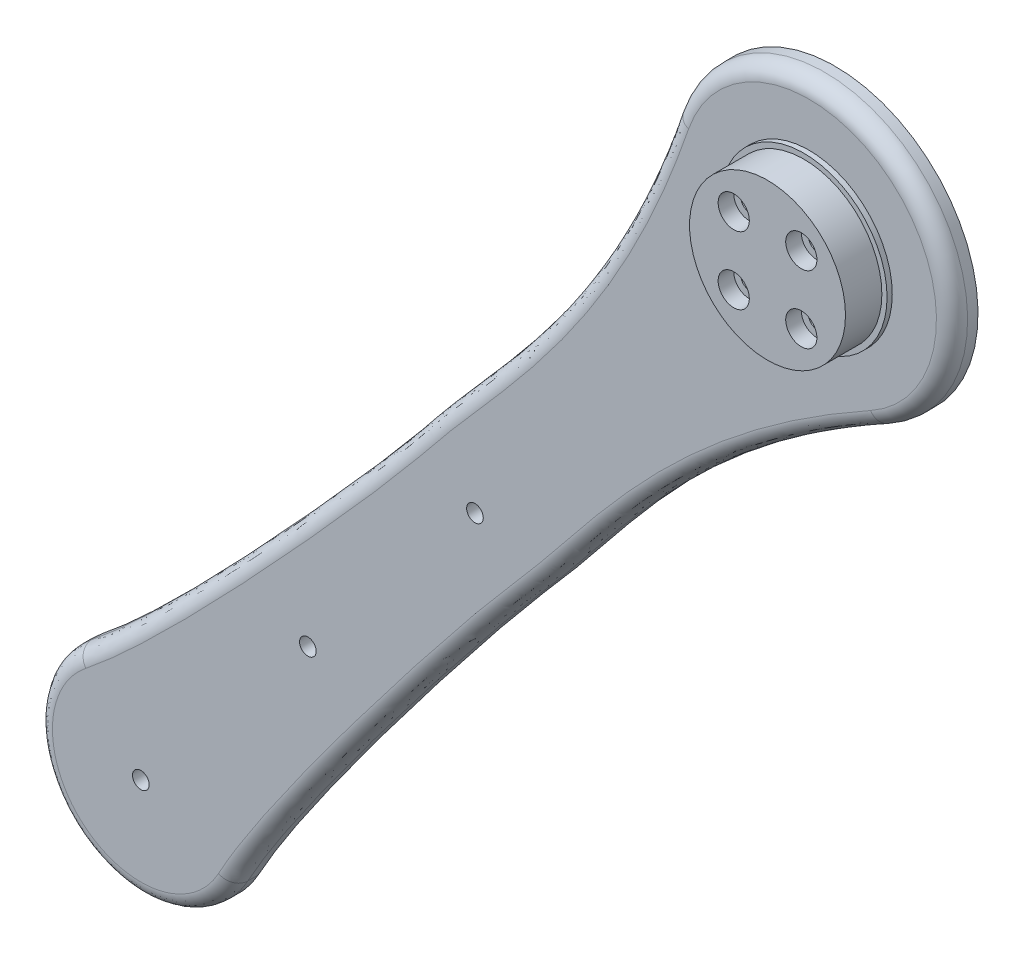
ISO-10303-21;
HEADER;
FILE_DESCRIPTION(('STEP AP214'),'2;1');
FILE_NAME('part.step','',(''),(''),'','','');
FILE_SCHEMA(('AUTOMOTIVE_DESIGN { 1 0 10303 214 1 1 1 1 }'));
ENDSEC;
DATA;
#1=APPLICATION_CONTEXT('core data for automotive mechanical design processes');
#2=APPLICATION_PROTOCOL_DEFINITION('international standard','automotive_design',2000,#1);
#3=PRODUCT_CONTEXT('',#1,'mechanical');
#4=PRODUCT('Part','Part','',(#3));
#5=PRODUCT_RELATED_PRODUCT_CATEGORY('part','',(#4));
#6=PRODUCT_DEFINITION_FORMATION('','',#4);
#7=PRODUCT_DEFINITION_CONTEXT('part definition',#1,'design');
#8=PRODUCT_DEFINITION('design','',#6,#7);
#9=PRODUCT_DEFINITION_SHAPE('','',#8);
#10=(LENGTH_UNIT() NAMED_UNIT(*) SI_UNIT(.MILLI.,.METRE.));
#11=(NAMED_UNIT(*) PLANE_ANGLE_UNIT() SI_UNIT($,.RADIAN.));
#12=(NAMED_UNIT(*) SI_UNIT($,.STERADIAN.) SOLID_ANGLE_UNIT());
#13=UNCERTAINTY_MEASURE_WITH_UNIT(LENGTH_MEASURE(1.E-05),#10,'distance_accuracy_value','');
#14=(GEOMETRIC_REPRESENTATION_CONTEXT(3) GLOBAL_UNCERTAINTY_ASSIGNED_CONTEXT((#13)) GLOBAL_UNIT_ASSIGNED_CONTEXT((#10,
#11,#12)) REPRESENTATION_CONTEXT('',''));
#15=CARTESIAN_POINT('',(0.,0.,0.));
#16=DIRECTION('',(0.,0.,1.));
#17=DIRECTION('',(1.,0.,0.));
#18=AXIS2_PLACEMENT_3D('',#15,#16,#17);
#19=CARTESIAN_POINT('',(148.218221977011,-112.41570779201,36.));
#20=DIRECTION('',(0.,0.,-1.));
#21=DIRECTION('',(-1.,0.,0.));
#22=AXIS2_PLACEMENT_3D('',#19,#20,#21);
#23=CYLINDRICAL_SURFACE('',#22,1.59999999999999);
#24=CARTESIAN_POINT('',(148.218221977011,-112.41570779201,31.));
#25=DIRECTION('',(0.,0.,1.));
#26=DIRECTION('',(1.,0.,0.));
#27=AXIS2_PLACEMENT_3D('',#24,#25,#26);
#28=CIRCLE('',#27,1.59999999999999);
#29=CARTESIAN_POINT('',(149.818221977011,-112.41570779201,31.));
#30=VERTEX_POINT('',#29);
#31=EDGE_CURVE('E124',#30,#30,#28,.T.);
#32=ORIENTED_EDGE('',*,*,#31,.F.);
#33=EDGE_LOOP('',(#32));
#34=FACE_BOUND('',#33,.T.);
#35=CARTESIAN_POINT('',(148.218221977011,-112.41570779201,41.));
#36=DIRECTION('',(0.,0.,1.));
#37=DIRECTION('',(1.,0.,0.));
#38=AXIS2_PLACEMENT_3D('',#35,#36,#37);
#39=CIRCLE('',#38,1.59999999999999);
#40=CARTESIAN_POINT('',(149.818221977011,-112.41570779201,41.));
#41=VERTEX_POINT('',#40);
#42=EDGE_CURVE('E225',#41,#41,#39,.T.);
#43=ORIENTED_EDGE('',*,*,#42,.T.);
#44=EDGE_LOOP('',(#43));
#45=FACE_BOUND('',#44,.T.);
#46=ADVANCED_FACE('F43',(#34,#45),#23,.F.);
#47=CARTESIAN_POINT('',(135.218221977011,-112.41570779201,36.));
#48=DIRECTION('',(0.,0.,-1.));
#49=DIRECTION('',(-1.,0.,0.));
#50=AXIS2_PLACEMENT_3D('',#47,#48,#49);
#51=CYLINDRICAL_SURFACE('',#50,1.59999999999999);
#52=CARTESIAN_POINT('',(135.218221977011,-112.41570779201,31.));
#53=DIRECTION('',(0.,0.,1.));
#54=DIRECTION('',(1.,0.,0.));
#55=AXIS2_PLACEMENT_3D('',#52,#53,#54);
#56=CIRCLE('',#55,1.59999999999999);
#57=CARTESIAN_POINT('',(136.818221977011,-112.41570779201,31.));
#58=VERTEX_POINT('',#57);
#59=EDGE_CURVE('E127',#58,#58,#56,.T.);
#60=ORIENTED_EDGE('',*,*,#59,.F.);
#61=EDGE_LOOP('',(#60));
#62=FACE_BOUND('',#61,.T.);
#63=CARTESIAN_POINT('',(135.218221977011,-112.41570779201,41.));
#64=DIRECTION('',(0.,0.,1.));
#65=DIRECTION('',(1.,0.,0.));
#66=AXIS2_PLACEMENT_3D('',#63,#64,#65);
#67=CIRCLE('',#66,1.59999999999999);
#68=CARTESIAN_POINT('',(136.818221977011,-112.41570779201,41.));
#69=VERTEX_POINT('',#68);
#70=EDGE_CURVE('E361',#69,#69,#67,.T.);
#71=ORIENTED_EDGE('',*,*,#70,.T.);
#72=EDGE_LOOP('',(#71));
#73=FACE_BOUND('',#72,.T.);
#74=ADVANCED_FACE('F309',(#62,#73),#51,.F.);
#75=CARTESIAN_POINT('',(148.218221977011,-125.41570779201,36.));
#76=DIRECTION('',(0.,0.,-1.));
#77=DIRECTION('',(-1.,0.,0.));
#78=AXIS2_PLACEMENT_3D('',#75,#76,#77);
#79=CYLINDRICAL_SURFACE('',#78,1.59999999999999);
#80=CARTESIAN_POINT('',(148.218221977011,-125.41570779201,31.));
#81=DIRECTION('',(0.,0.,1.));
#82=DIRECTION('',(1.,0.,0.));
#83=AXIS2_PLACEMENT_3D('',#80,#81,#82);
#84=CIRCLE('',#83,1.59999999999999);
#85=CARTESIAN_POINT('',(149.818221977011,-125.41570779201,31.));
#86=VERTEX_POINT('',#85);
#87=EDGE_CURVE('E189',#86,#86,#84,.T.);
#88=ORIENTED_EDGE('',*,*,#87,.F.);
#89=EDGE_LOOP('',(#88));
#90=FACE_BOUND('',#89,.T.);
#91=CARTESIAN_POINT('',(148.218221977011,-125.41570779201,41.));
#92=DIRECTION('',(0.,0.,1.));
#93=DIRECTION('',(1.,0.,0.));
#94=AXIS2_PLACEMENT_3D('',#91,#92,#93);
#95=CIRCLE('',#94,1.59999999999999);
#96=CARTESIAN_POINT('',(149.818221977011,-125.41570779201,41.));
#97=VERTEX_POINT('',#96);
#98=EDGE_CURVE('E358',#97,#97,#95,.T.);
#99=ORIENTED_EDGE('',*,*,#98,.T.);
#100=EDGE_LOOP('',(#99));
#101=FACE_BOUND('',#100,.T.);
#102=ADVANCED_FACE('F315',(#90,#101),#79,.F.);
#103=CARTESIAN_POINT('',(135.218221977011,-125.41570779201,36.));
#104=DIRECTION('',(0.,0.,-1.));
#105=DIRECTION('',(-1.,0.,0.));
#106=AXIS2_PLACEMENT_3D('',#103,#104,#105);
#107=CYLINDRICAL_SURFACE('',#106,1.59999999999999);
#108=CARTESIAN_POINT('',(135.218221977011,-125.41570779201,31.));
#109=DIRECTION('',(0.,0.,1.));
#110=DIRECTION('',(1.,0.,0.));
#111=AXIS2_PLACEMENT_3D('',#108,#109,#110);
#112=CIRCLE('',#111,1.59999999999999);
#113=CARTESIAN_POINT('',(136.818221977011,-125.41570779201,31.));
#114=VERTEX_POINT('',#113);
#115=EDGE_CURVE('E192',#114,#114,#112,.T.);
#116=ORIENTED_EDGE('',*,*,#115,.F.);
#117=EDGE_LOOP('',(#116));
#118=FACE_BOUND('',#117,.T.);
#119=CARTESIAN_POINT('',(135.218221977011,-125.41570779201,41.));
#120=DIRECTION('',(0.,0.,1.));
#121=DIRECTION('',(1.,0.,0.));
#122=AXIS2_PLACEMENT_3D('',#119,#120,#121);
#123=CIRCLE('',#122,1.59999999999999);
#124=CARTESIAN_POINT('',(136.818221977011,-125.41570779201,41.));
#125=VERTEX_POINT('',#124);
#126=EDGE_CURVE('E233',#125,#125,#123,.T.);
#127=ORIENTED_EDGE('',*,*,#126,.T.);
#128=EDGE_LOOP('',(#127));
#129=FACE_BOUND('',#128,.T.);
#130=ADVANCED_FACE('F287',(#118,#129),#107,.F.);
#131=CARTESIAN_POINT('',(76.5989589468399,-175.143739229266,36.));
#132=DIRECTION('',(0.,0.,1.));
#133=DIRECTION('',(1.,0.,0.));
#134=AXIS2_PLACEMENT_3D('',#131,#132,#133);
#135=PLANE('',#134);
#136=CARTESIAN_POINT('',(2.58991826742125,-258.810747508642,36.));
#137=CARTESIAN_POINT('',(6.1972455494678,-255.946641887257,36.));
#138=CARTESIAN_POINT('',(10.4993930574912,-252.03269432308,36.));
#139=CARTESIAN_POINT('',(19.8643080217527,-242.967357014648,36.));
#140=CARTESIAN_POINT('',(24.9218403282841,-237.816883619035,36.));
#141=CARTESIAN_POINT('',(40.112106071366,-221.887775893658,36.));
#142=CARTESIAN_POINT('',(50.2589573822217,-210.634653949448,36.));
#143=CARTESIAN_POINT('',(59.1915358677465,-200.421978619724,36.));
#144=CARTESIAN_POINT('',(60.7905215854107,-198.57206986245,36.));
#145=CARTESIAN_POINT('',(63.521691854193,-195.370215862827,36.));
#146=CARTESIAN_POINT('',(64.6537458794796,-194.018479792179,36.));
#147=CARTESIAN_POINT('',(67.5813511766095,-190.476104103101,36.));
#148=CARTESIAN_POINT('',(68.9057809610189,-188.801822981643,36.));
#149=CARTESIAN_POINT('',(70.5388406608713,-186.801529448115,36.));
#150=CARTESIAN_POINT('',(70.8660700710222,-186.404271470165,36.));
#151=CARTESIAN_POINT('',(71.5336551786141,-185.601365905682,36.));
#152=CARTESIAN_POINT('',(71.8724257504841,-185.197431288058,36.));
#153=CARTESIAN_POINT('',(72.9029751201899,-183.977385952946,36.));
#154=CARTESIAN_POINT('',(73.6089943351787,-183.153036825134,36.));
#155=CARTESIAN_POINT('',(75.7783171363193,-180.640553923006,36.));
#156=CARTESIAN_POINT('',(77.2929055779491,-178.913024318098,36.));
#157=CARTESIAN_POINT('',(85.1297962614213,-169.923589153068,36.));
#158=CARTESIAN_POINT('',(92.2433853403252,-161.608858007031,36.));
#159=CARTESIAN_POINT('',(106.13347228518,-140.352759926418,36.));
#160=CARTESIAN_POINT('',(112.905809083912,-127.409635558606,36.));
#161=CARTESIAN_POINT('',(118.542636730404,-110.969498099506,36.));
#162=(BOUNDED_CURVE() B_SPLINE_CURVE(3,(#136,#137,#138,#139,#140,#141,#142,#143,#144,#145,#146,
#147,#148,#149,#150,#151,#152,#153,#154,#155,#156,#157,#158,#159,#160,#161),.UNSPECIFIED.,.F.,
.F.) B_SPLINE_CURVE_WITH_KNOTS((4,2,2,2,2,2,2,2,2,2,2,2,4),(0.,0.0625,0.125,0.25,0.28125,0.3125,
0.375,0.390625,0.40625,0.4375,0.5,0.75,1.),
.UNSPECIFIED.) CURVE() GEOMETRIC_REPRESENTATION_ITEM() RATIONAL_B_SPLINE_CURVE((1.,1.,1.,1.,1.,
1.,1.,1.,1.,1.,1.,1.,1.,1.,1.,1.,1.,1.,1.,1.,1.,1.,1.,1.,1.,1.)) REPRESENTATION_ITEM(''));
#163=CARTESIAN_POINT('',(118.542636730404,-110.969498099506,36.));
#164=VERTEX_POINT('',#163);
#165=CARTESIAN_POINT('',(2.58991826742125,-258.810747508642,36.));
#166=VERTEX_POINT('',#165);
#167=EDGE_CURVE('E381',#164,#166,#162,.F.);
#168=ORIENTED_EDGE('',*,*,#167,.T.);
#169=CARTESIAN_POINT('',(28.107878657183,-280.222858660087,36.));
#170=CARTESIAN_POINT('',(27.509808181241,-281.326733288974,36.));
#171=CARTESIAN_POINT('',(26.7890058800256,-282.364003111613,36.));
#172=CARTESIAN_POINT('',(25.1369941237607,-284.254911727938,36.));
#173=CARTESIAN_POINT('',(24.2058618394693,-285.108454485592,36.));
#174=CARTESIAN_POINT('',(22.1787149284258,-286.590127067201,36.));
#175=CARTESIAN_POINT('',(21.0827815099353,-287.218197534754,36.));
#176=CARTESIAN_POINT('',(18.7795953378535,-288.218203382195,36.));
#177=CARTESIAN_POINT('',(17.5724348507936,-288.590098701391,36.));
#178=CARTESIAN_POINT('',(15.1057993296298,-289.059553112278,36.));
#179=CARTESIAN_POINT('',(13.846423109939,-289.157093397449,36.));
#180=CARTESIAN_POINT('',(11.3369182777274,-289.073047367,36.));
#181=CARTESIAN_POINT('',(10.0868901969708,-288.89146441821,36.));
#182=CARTESIAN_POINT('',(7.65719173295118,-288.258026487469,36.));
#183=CARTESIAN_POINT('',(6.47761868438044,-287.806196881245,36.));
#184=CARTESIAN_POINT('',(4.2465009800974,-286.654332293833,36.));
#185=CARTESIAN_POINT('',(3.1950457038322,-285.954343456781,36.));
#186=CARTESIAN_POINT('',(1.27157564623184,-284.340360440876,36.));
#187=CARTESIAN_POINT('',(0.399637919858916,-283.426430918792,36.));
#188=CARTESIAN_POINT('',(-1.12215677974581,-281.429228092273,36.));
#189=CARTESIAN_POINT('',(-1.77195278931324,-280.346034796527,36.));
#190=CARTESIAN_POINT('',(-2.81768008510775,-278.06324425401,36.));
#191=CARTESIAN_POINT('',(-3.21356947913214,-276.863738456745,36.));
#192=CARTESIAN_POINT('',(-3.73210960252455,-274.406953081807,36.));
#193=CARTESIAN_POINT('',(-3.85473955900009,-273.149771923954,36.));
#194=CARTESIAN_POINT('',(-3.82074397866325,-270.639090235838,36.));
#195=CARTESIAN_POINT('',(-3.66411980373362,-269.38569028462,36.));
#196=CARTESIAN_POINT('',(-3.07925037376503,-266.943845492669,36.));
#197=CARTESIAN_POINT('',(-2.6510285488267,-265.755498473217,36.));
#198=CARTESIAN_POINT('',(-1.5438762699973,-263.501858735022,36.));
#199=CARTESIAN_POINT('',(-0.86499016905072,-262.436656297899,36.));
#200=CARTESIAN_POINT('',(0.710322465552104,-260.481389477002,36.));
#201=CARTESIAN_POINT('',(1.60666782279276,-259.59141776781,36.));
#202=CARTESIAN_POINT('',(2.58991826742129,-258.810747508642,36.));
#203=(BOUNDED_CURVE() B_SPLINE_CURVE(3,(#169,#170,#171,#172,#173,#174,#175,#176,#177,#178,#179,
#180,#181,#182,#183,#184,#185,#186,#187,#188,#189,#190,#191,#192,#193,#194,#195,#196,#197,#198,
#199,#200,#201,#202),.UNSPECIFIED.,.F.,.F.) B_SPLINE_CURVE_WITH_KNOTS((4,2,2,2,2,2,2,2,2,2,2,2,
2,2,2,2,4),(2.24184892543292,2.46339996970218,2.68495101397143,2.90650205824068,
3.12805310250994,3.34960414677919,3.57115519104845,3.7927062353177,4.01425727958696,
4.23580832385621,4.45735936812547,4.67891041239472,4.90046145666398,5.12201250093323,
5.34356354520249,5.56511458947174,5.786665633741),
.UNSPECIFIED.) CURVE() GEOMETRIC_REPRESENTATION_ITEM() RATIONAL_B_SPLINE_CURVE((1.,1.,1.,1.,1.,
1.,1.,1.,1.,1.,1.,1.,1.,1.,1.,1.,1.,1.,1.,1.,1.,1.,1.,1.,1.,1.,1.,1.,1.,1.,1.,1.,1.,1.)) REPRESENTATION_ITEM(''));
#204=CARTESIAN_POINT('',(28.107878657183,-280.222858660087,36.));
#205=VERTEX_POINT('',#204);
#206=EDGE_CURVE('E343',#166,#205,#203,.F.);
#207=ORIENTED_EDGE('',*,*,#206,.T.);
#208=CARTESIAN_POINT('',(153.568109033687,-140.359358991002,36.));
#209=CARTESIAN_POINT('',(138.356559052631,-148.765350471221,36.));
#210=CARTESIAN_POINT('',(126.786073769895,-157.682350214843,36.));
#211=CARTESIAN_POINT('',(108.264891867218,-175.052498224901,36.));
#212=CARTESIAN_POINT('',(101.311741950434,-183.501853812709,36.));
#213=CARTESIAN_POINT('',(93.8197382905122,-192.780683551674,36.));
#214=CARTESIAN_POINT('',(92.3814592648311,-194.572244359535,36.));
#215=CARTESIAN_POINT('',(90.2838455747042,-197.144898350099,36.));
#216=CARTESIAN_POINT('',(89.594619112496,-197.983338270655,36.));
#217=CARTESIAN_POINT('',(88.5720620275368,-199.210089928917,36.));
#218=CARTESIAN_POINT('',(88.2330909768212,-199.613856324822,36.));
#219=CARTESIAN_POINT('',(87.55830828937,-200.410722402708,36.));
#220=CARTESIAN_POINT('',(87.223908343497,-200.80196358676,36.));
#221=CARTESIAN_POINT('',(85.5375816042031,-202.757560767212,36.));
#222=CARTESIAN_POINT('',(84.1187213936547,-204.352605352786,36.));
#223=CARTESIAN_POINT('',(81.1385356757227,-207.850860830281,36.));
#224=CARTESIAN_POINT('',(80.0039146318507,-209.200442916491,36.));
#225=CARTESIAN_POINT('',(77.3249667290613,-212.446116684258,36.));
#226=CARTESIAN_POINT('',(75.7808231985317,-214.34204350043,36.));
#227=CARTESIAN_POINT('',(67.2744273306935,-224.912328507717,36.));
#228=CARTESIAN_POINT('',(57.9542478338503,-236.859110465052,36.));
#229=CARTESIAN_POINT('',(44.9049010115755,-254.584662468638,36.));
#230=CARTESIAN_POINT('',(40.710906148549,-260.459729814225,36.));
#231=CARTESIAN_POINT('',(33.4094921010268,-271.256549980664,36.));
#232=CARTESIAN_POINT('',(30.3020662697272,-276.172988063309,36.));
#233=CARTESIAN_POINT('',(28.107878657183,-280.222858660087,36.));
#234=(BOUNDED_CURVE() B_SPLINE_CURVE(3,(#208,#209,#210,#211,#212,#213,#214,#215,#216,#217,#218,
#219,#220,#221,#222,#223,#224,#225,#226,#227,#228,#229,#230,#231,#232,#233),.UNSPECIFIED.,.F.,
.F.) B_SPLINE_CURVE_WITH_KNOTS((4,2,2,2,2,2,2,2,2,2,2,2,4),(0.,0.25,0.5,0.5625,0.59375,0.609375,
0.625,0.6875,0.71875,0.75,0.875,0.9375,1.),
.UNSPECIFIED.) CURVE() GEOMETRIC_REPRESENTATION_ITEM() RATIONAL_B_SPLINE_CURVE((1.,1.,1.,1.,1.,
1.,1.,1.,1.,1.,1.,1.,1.,1.,1.,1.,1.,1.,1.,1.,1.,1.,1.,1.,1.,1.)) REPRESENTATION_ITEM(''));
#235=CARTESIAN_POINT('',(153.568109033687,-140.359358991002,36.));
#236=VERTEX_POINT('',#235);
#237=EDGE_CURVE('E222',#205,#236,#234,.F.);
#238=ORIENTED_EDGE('',*,*,#237,.T.);
#239=CARTESIAN_POINT('',(141.718221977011,-118.91570779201,36.));
#240=DIRECTION('',(0.,0.,1.));
#241=DIRECTION('',(1.,0.,0.));
#242=AXIS2_PLACEMENT_3D('',#239,#240,#241);
#243=CIRCLE('',#242,24.5);
#244=EDGE_CURVE('E367',#236,#164,#243,.T.);
#245=ORIENTED_EDGE('',*,*,#244,.T.);
#246=EDGE_LOOP('',(#168,#207,#238,#245));
#247=FACE_BOUND('',#246,.T.);
#248=CARTESIAN_POINT('',(141.718221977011,-118.91570779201,36.));
#249=DIRECTION('',(0.,0.,1.));
#250=DIRECTION('',(1.,0.,0.));
#251=AXIS2_PLACEMENT_3D('',#248,#249,#250);
#252=CIRCLE('',#251,16.);
#253=CARTESIAN_POINT('',(157.718221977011,-118.91570779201,36.));
#254=VERTEX_POINT('',#253);
#255=EDGE_CURVE('E214',#254,#254,#252,.T.);
#256=ORIENTED_EDGE('',*,*,#255,.F.);
#257=EDGE_LOOP('',(#256));
#258=FACE_BOUND('',#257,.T.);
#259=CARTESIAN_POINT('',(45.3000805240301,-233.822374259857,36.));
#260=DIRECTION('',(0.,0.,1.));
#261=DIRECTION('',(1.,0.,0.));
#262=AXIS2_PLACEMENT_3D('',#259,#260,#261);
#263=CIRCLE('',#262,1.6);
#264=CARTESIAN_POINT('',(46.9000805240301,-233.822374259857,36.));
#265=VERTEX_POINT('',#264);
#266=EDGE_CURVE('E199',#265,#265,#263,.T.);
#267=ORIENTED_EDGE('',*,*,#266,.F.);
#268=EDGE_LOOP('',(#267));
#269=FACE_BOUND('',#268,.T.);
#270=CARTESIAN_POINT('',(77.439461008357,-195.520152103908,36.));
#271=DIRECTION('',(0.,0.,1.));
#272=DIRECTION('',(1.,0.,0.));
#273=AXIS2_PLACEMENT_3D('',#270,#271,#272);
#274=CIRCLE('',#273,1.60000000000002);
#275=CARTESIAN_POINT('',(79.039461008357,-195.520152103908,36.));
#276=VERTEX_POINT('',#275);
#277=EDGE_CURVE('E195',#276,#276,#274,.T.);
#278=ORIENTED_EDGE('',*,*,#277,.F.);
#279=EDGE_LOOP('',(#278));
#280=FACE_BOUND('',#279,.T.);
#281=CARTESIAN_POINT('',(13.1607000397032,-272.124596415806,36.));
#282=DIRECTION('',(0.,0.,1.));
#283=DIRECTION('',(1.,0.,0.));
#284=AXIS2_PLACEMENT_3D('',#281,#282,#283);
#285=CIRCLE('',#284,1.6);
#286=CARTESIAN_POINT('',(14.7607000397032,-272.124596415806,36.));
#287=VERTEX_POINT('',#286);
#288=EDGE_CURVE('E205',#287,#287,#285,.T.);
#289=ORIENTED_EDGE('',*,*,#288,.F.);
#290=EDGE_LOOP('',(#289));
#291=FACE_BOUND('',#290,.T.);
#292=ADVANCED_FACE('F284',(#247,#258,#269,#280,#291),#135,.T.);
#293=CARTESIAN_POINT('',(76.5989589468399,-175.143739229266,31.));
#294=DIRECTION('',(0.,0.,1.));
#295=DIRECTION('',(1.,0.,0.));
#296=AXIS2_PLACEMENT_3D('',#293,#294,#295);
#297=PLANE('',#296);
#298=CARTESIAN_POINT('',(115.704809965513,-109.996492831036,31.));
#299=CARTESIAN_POINT('',(101.948797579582,-150.116707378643,31.));
#300=CARTESIAN_POINT('',(78.1787907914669,-171.772825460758,31.));
#301=CARTESIAN_POINT('',(58.7170794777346,-197.082387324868,31.));
#302=CARTESIAN_POINT('',(16.3569995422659,-244.049515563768,31.));
#303=CARTESIAN_POINT('',(0.724486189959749,-256.461244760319,31.));
#304=B_SPLINE_CURVE_WITH_KNOTS('',3,(#298,#299,#300,#301,#302,#303),.UNSPECIFIED.,.F.,.F.,(4,1,
1,4),(0.,0.619090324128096,0.719090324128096,1.),.UNSPECIFIED.);
#305=CARTESIAN_POINT('',(115.704809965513,-109.996492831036,31.));
#306=VERTEX_POINT('',#305);
#307=CARTESIAN_POINT('',(0.724486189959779,-256.461244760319,31.));
#308=VERTEX_POINT('',#307);
#309=EDGE_CURVE('E117',#306,#308,#304,.T.);
#310=ORIENTED_EDGE('',*,*,#309,.F.);
#311=CARTESIAN_POINT('',(141.718221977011,-118.91570779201,31.));
#312=DIRECTION('',(0.,0.,1.));
#313=DIRECTION('',(1.,0.,0.));
#314=AXIS2_PLACEMENT_3D('',#311,#312,#313);
#315=CIRCLE('',#314,27.5);
#316=CARTESIAN_POINT('',(155.019115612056,-142.985112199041,31.));
#317=VERTEX_POINT('',#316);
#318=EDGE_CURVE('E143',#317,#306,#315,.T.);
#319=ORIENTED_EDGE('',*,*,#318,.F.);
#320=CARTESIAN_POINT('',(30.7456160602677,-281.651963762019,31.));
#321=CARTESIAN_POINT('',(40.2542257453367,-264.101669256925,31.));
#322=CARTESIAN_POINT('',(79.1520670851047,-214.229377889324,31.));
#323=CARTESIAN_POINT('',(100.697629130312,-190.668374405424,31.));
#324=CARTESIAN_POINT('',(117.89712375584,-163.498941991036,31.));
#325=CARTESIAN_POINT('',(155.019115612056,-142.985112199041,31.));
#326=B_SPLINE_CURVE_WITH_KNOTS('',3,(#320,#321,#322,#323,#324,#325),.UNSPECIFIED.,.F.,.F.,(4,1,
1,4),(0.,0.280909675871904,0.380909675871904,1.),.UNSPECIFIED.);
#327=CARTESIAN_POINT('',(30.7456160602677,-281.651963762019,31.));
#328=VERTEX_POINT('',#327);
#329=EDGE_CURVE('E119',#328,#317,#326,.T.);
#330=ORIENTED_EDGE('',*,*,#329,.F.);
#331=CARTESIAN_POINT('',(13.1607000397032,-272.124596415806,31.));
#332=DIRECTION('',(0.,0.,1.));
#333=DIRECTION('',(1.,0.,0.));
#334=AXIS2_PLACEMENT_3D('',#331,#332,#333);
#335=CIRCLE('',#334,20.);
#336=EDGE_CURVE('E103',#308,#328,#335,.T.);
#337=ORIENTED_EDGE('',*,*,#336,.F.);
#338=EDGE_LOOP('',(#310,#319,#330,#337));
#339=FACE_BOUND('',#338,.T.);
#340=ORIENTED_EDGE('',*,*,#31,.T.);
#341=EDGE_LOOP('',(#340));
#342=FACE_BOUND('',#341,.T.);
#343=ORIENTED_EDGE('',*,*,#59,.T.);
#344=EDGE_LOOP('',(#343));
#345=FACE_BOUND('',#344,.T.);
#346=ORIENTED_EDGE('',*,*,#87,.T.);
#347=EDGE_LOOP('',(#346));
#348=FACE_BOUND('',#347,.T.);
#349=ORIENTED_EDGE('',*,*,#115,.T.);
#350=EDGE_LOOP('',(#349));
#351=FACE_BOUND('',#350,.T.);
#352=CARTESIAN_POINT('',(77.439461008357,-195.520152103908,31.));
#353=DIRECTION('',(0.,0.,1.));
#354=DIRECTION('',(1.,0.,0.));
#355=AXIS2_PLACEMENT_3D('',#352,#353,#354);
#356=CIRCLE('',#355,1.60000000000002);
#357=CARTESIAN_POINT('',(79.039461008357,-195.520152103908,31.));
#358=VERTEX_POINT('',#357);
#359=EDGE_CURVE('E196',#358,#358,#356,.T.);
#360=ORIENTED_EDGE('',*,*,#359,.T.);
#361=EDGE_LOOP('',(#360));
#362=FACE_BOUND('',#361,.T.);
#363=CARTESIAN_POINT('',(45.3000805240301,-233.822374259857,31.));
#364=DIRECTION('',(0.,0.,1.));
#365=DIRECTION('',(1.,0.,0.));
#366=AXIS2_PLACEMENT_3D('',#363,#364,#365);
#367=CIRCLE('',#366,1.6);
#368=CARTESIAN_POINT('',(46.9000805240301,-233.822374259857,31.));
#369=VERTEX_POINT('',#368);
#370=EDGE_CURVE('E202',#369,#369,#367,.T.);
#371=ORIENTED_EDGE('',*,*,#370,.T.);
#372=EDGE_LOOP('',(#371));
#373=FACE_BOUND('',#372,.T.);
#374=CARTESIAN_POINT('',(13.1607000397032,-272.124596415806,31.));
#375=DIRECTION('',(0.,0.,1.));
#376=DIRECTION('',(1.,0.,0.));
#377=AXIS2_PLACEMENT_3D('',#374,#375,#376);
#378=CIRCLE('',#377,1.6);
#379=CARTESIAN_POINT('',(14.7607000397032,-272.124596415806,31.));
#380=VERTEX_POINT('',#379);
#381=EDGE_CURVE('E208',#380,#380,#378,.T.);
#382=ORIENTED_EDGE('',*,*,#381,.T.);
#383=EDGE_LOOP('',(#382));
#384=FACE_BOUND('',#383,.T.);
#385=ADVANCED_FACE('F114',(#339,#342,#345,#348,#351,#362,#373,#384),#297,.F.);
#386=CARTESIAN_POINT('',(115.704809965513,-109.996492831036,36.));
#387=CARTESIAN_POINT('',(101.948797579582,-150.116707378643,36.));
#388=CARTESIAN_POINT('',(78.1787907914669,-171.772825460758,36.));
#389=CARTESIAN_POINT('',(58.7170794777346,-197.082387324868,36.));
#390=CARTESIAN_POINT('',(16.3569995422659,-244.049515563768,36.));
#391=CARTESIAN_POINT('',(0.724486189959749,-256.461244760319,36.));
#392=B_SPLINE_CURVE_WITH_KNOTS('',3,(#386,#387,#388,#389,#390,#391),.UNSPECIFIED.,.F.,.F.,(4,1,
1,4),(0.,0.619090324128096,0.719090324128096,1.),.UNSPECIFIED.);
#393=DIRECTION('',(0.,0.,-1.));
#394=VECTOR('',#393,1.);
#395=SURFACE_OF_LINEAR_EXTRUSION('',#392,#394);
#396=DIRECTION('',(0.,0.,-1.));
#397=VECTOR('',#396,1.);
#398=CARTESIAN_POINT('',(0.724486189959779,-256.461244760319,36.));
#399=LINE('',#398,#397);
#400=CARTESIAN_POINT('',(0.724486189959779,-256.461244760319,33.));
#401=VERTEX_POINT('',#400);
#402=EDGE_CURVE('E99',#401,#308,#399,.T.);
#403=ORIENTED_EDGE('',*,*,#402,.F.);
#404=CARTESIAN_POINT('',(0.724486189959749,-256.461244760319,33.));
#405=CARTESIAN_POINT('',(16.3569995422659,-244.049515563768,33.));
#406=CARTESIAN_POINT('',(58.7170794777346,-197.082387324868,33.));
#407=CARTESIAN_POINT('',(78.1787907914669,-171.772825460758,33.));
#408=CARTESIAN_POINT('',(101.948797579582,-150.116707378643,33.));
#409=CARTESIAN_POINT('',(115.704809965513,-109.996492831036,33.));
#410=B_SPLINE_CURVE_WITH_KNOTS('',3,(#404,#405,#406,#407,#408,#409),.UNSPECIFIED.,.F.,.F.,(4,1,
1,4),(0.,0.280909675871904,0.380909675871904,1.),.UNSPECIFIED.);
#411=CARTESIAN_POINT('',(115.704809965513,-109.996492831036,33.));
#412=VERTEX_POINT('',#411);
#413=EDGE_CURVE('E68',#401,#412,#410,.T.);
#414=ORIENTED_EDGE('',*,*,#413,.T.);
#415=DIRECTION('',(0.,0.,-1.));
#416=VECTOR('',#415,1.);
#417=CARTESIAN_POINT('',(115.704809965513,-109.996492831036,36.));
#418=LINE('',#417,#416);
#419=EDGE_CURVE('E122',#412,#306,#418,.T.);
#420=ORIENTED_EDGE('',*,*,#419,.T.);
#421=ORIENTED_EDGE('',*,*,#309,.T.);
#422=EDGE_LOOP('',(#403,#414,#420,#421));
#423=FACE_BOUND('',#422,.T.);
#424=ADVANCED_FACE('F121',(#423),#395,.F.);
#425=CARTESIAN_POINT('',(13.1607000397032,-272.124596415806,36.));
#426=DIRECTION('',(0.,0.,-1.));
#427=DIRECTION('',(-1.,0.,0.));
#428=AXIS2_PLACEMENT_3D('',#425,#426,#427);
#429=CYLINDRICAL_SURFACE('',#428,20.);
#430=DIRECTION('',(0.,0.,-1.));
#431=VECTOR('',#430,1.);
#432=CARTESIAN_POINT('',(30.7456160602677,-281.651963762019,36.));
#433=LINE('',#432,#431);
#434=CARTESIAN_POINT('',(30.7456160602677,-281.651963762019,32.999999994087));
#435=VERTEX_POINT('',#434);
#436=EDGE_CURVE('E110',#435,#328,#433,.T.);
#437=ORIENTED_EDGE('',*,*,#436,.F.);
#438=CARTESIAN_POINT('',(0.724486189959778,-256.461244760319,33.));
#439=CARTESIAN_POINT('',(-0.432279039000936,-257.379680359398,33.));
#440=CARTESIAN_POINT('',(-1.48680298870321,-258.426705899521,33.));
#441=CARTESIAN_POINT('',(-3.34011197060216,-260.727019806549,33.));
#442=CARTESIAN_POINT('',(-4.13880150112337,-261.980199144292,33.));
#443=CARTESIAN_POINT('',(-5.44133359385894,-264.631540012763,33.));
#444=CARTESIAN_POINT('',(-5.94512397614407,-266.029595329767,33.));
#445=CARTESIAN_POINT('',(-6.63320565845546,-268.902353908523,33.));
#446=CARTESIAN_POINT('',(-6.81746939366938,-270.376942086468,33.));
#447=CARTESIAN_POINT('',(-6.85746419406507,-273.330685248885,33.));
#448=CARTESIAN_POINT('',(-6.71319365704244,-274.809721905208,33.));
#449=CARTESIAN_POINT('',(-6.10314645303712,-277.700057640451,33.));
#450=CARTESIAN_POINT('',(-5.63739422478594,-279.11124093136,33.));
#451=CARTESIAN_POINT('',(-4.40712681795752,-281.796876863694,33.));
#452=CARTESIAN_POINT('',(-3.64266092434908,-283.071221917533,33.));
#453=CARTESIAN_POINT('',(-1.8523142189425,-285.42087230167,33.));
#454=CARTESIAN_POINT('',(-0.826505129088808,-286.496083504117,33.));
#455=CARTESIAN_POINT('',(1.43640082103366,-288.394887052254,33.));
#456=CARTESIAN_POINT('',(2.67340702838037,-289.218403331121,33.));
#457=CARTESIAN_POINT('',(5.2982513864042,-290.573538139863,33.));
#458=CARTESIAN_POINT('',(6.68598438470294,-291.105102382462,33.));
#459=CARTESIAN_POINT('',(9.54445316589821,-291.850323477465,33.));
#460=CARTESIAN_POINT('',(11.0150744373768,-292.063950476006,33.));
#461=CARTESIAN_POINT('',(13.967433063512,-292.162828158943,33.));
#462=CARTESIAN_POINT('',(15.4490521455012,-292.04807488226,33.));
#463=CARTESIAN_POINT('',(18.3509762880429,-291.495775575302,33.));
#464=CARTESIAN_POINT('',(19.7711650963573,-291.058251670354,33.));
#465=CARTESIAN_POINT('',(22.4807958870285,-289.881774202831,33.));
#466=CARTESIAN_POINT('',(23.7701293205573,-289.142867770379,33.));
#467=CARTESIAN_POINT('',(26.1550080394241,-287.39972355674,33.));
#468=CARTESIAN_POINT('',(27.2504577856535,-286.395555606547,33.));
#469=CARTESIAN_POINT('',(29.1940010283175,-284.170957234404,33.));
#470=CARTESIAN_POINT('',(30.0420037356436,-282.95063979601,33.));
#471=CARTESIAN_POINT('',(30.7456160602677,-281.651963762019,33.));
#472=(BOUNDED_CURVE() B_SPLINE_CURVE(3,(#438,#439,#440,#441,#442,#443,#444,#445,#446,#447,#448,
#449,#450,#451,#452,#453,#454,#455,#456,#457,#458,#459,#460,#461,#462,#463,#464,#465,#466,#467,
#468,#469,#470,#471),.UNSPECIFIED.,.F.,.F.) B_SPLINE_CURVE_WITH_KNOTS((4,2,2,2,2,2,2,2,2,2,2,2,
2,2,2,2,4),(2.24184892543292,2.46339996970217,2.68495101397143,2.90650205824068,
3.12805310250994,3.34960414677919,3.57115519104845,3.7927062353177,4.01425727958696,
4.23580832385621,4.45735936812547,4.67891041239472,4.90046145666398,5.12201250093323,
5.34356354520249,5.56511458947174,5.786665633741),
.UNSPECIFIED.) CURVE() GEOMETRIC_REPRESENTATION_ITEM() RATIONAL_B_SPLINE_CURVE((1.,1.,1.,1.,1.,
1.,1.,1.,1.,1.,1.,1.,1.,1.,1.,1.,1.,1.,1.,1.,1.,1.,1.,1.,1.,1.,1.,1.,1.,1.,1.,1.,1.,1.)) REPRESENTATION_ITEM(''));
#473=EDGE_CURVE('E106',#435,#401,#472,.F.);
#474=ORIENTED_EDGE('',*,*,#473,.T.);
#475=ORIENTED_EDGE('',*,*,#402,.T.);
#476=ORIENTED_EDGE('',*,*,#336,.T.);
#477=EDGE_LOOP('',(#437,#474,#475,#476));
#478=FACE_BOUND('',#477,.T.);
#479=ADVANCED_FACE('F102',(#478),#429,.T.);
#480=CARTESIAN_POINT('',(30.7456160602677,-281.651963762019,36.));
#481=CARTESIAN_POINT('',(40.2542257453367,-264.101669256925,36.));
#482=CARTESIAN_POINT('',(79.1520670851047,-214.229377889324,36.));
#483=CARTESIAN_POINT('',(100.697629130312,-190.668374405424,36.));
#484=CARTESIAN_POINT('',(117.89712375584,-163.498941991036,36.));
#485=CARTESIAN_POINT('',(155.019115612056,-142.985112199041,36.));
#486=B_SPLINE_CURVE_WITH_KNOTS('',3,(#480,#481,#482,#483,#484,#485),.UNSPECIFIED.,.F.,.F.,(4,1,
1,4),(0.,0.280909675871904,0.380909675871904,1.),.UNSPECIFIED.);
#487=DIRECTION('',(0.,0.,-1.));
#488=VECTOR('',#487,1.);
#489=SURFACE_OF_LINEAR_EXTRUSION('',#486,#488);
#490=DIRECTION('',(0.,0.,-1.));
#491=VECTOR('',#490,1.);
#492=CARTESIAN_POINT('',(155.019115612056,-142.985112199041,36.));
#493=LINE('',#492,#491);
#494=CARTESIAN_POINT('',(155.019115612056,-142.985112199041,33.));
#495=VERTEX_POINT('',#494);
#496=EDGE_CURVE('E154',#495,#317,#493,.T.);
#497=ORIENTED_EDGE('',*,*,#496,.F.);
#498=CARTESIAN_POINT('',(155.019115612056,-142.985112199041,33.));
#499=CARTESIAN_POINT('',(117.89712375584,-163.498941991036,33.));
#500=CARTESIAN_POINT('',(100.697629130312,-190.668374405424,33.));
#501=CARTESIAN_POINT('',(79.1520670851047,-214.229377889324,33.));
#502=CARTESIAN_POINT('',(40.2542257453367,-264.101669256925,33.));
#503=CARTESIAN_POINT('',(30.7456160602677,-281.651963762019,33.));
#504=B_SPLINE_CURVE_WITH_KNOTS('',3,(#498,#499,#500,#501,#502,#503),.UNSPECIFIED.,.F.,.F.,(4,1,
1,4),(0.,0.619090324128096,0.719090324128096,1.),.UNSPECIFIED.);
#505=EDGE_CURVE('E11',#495,#435,#504,.T.);
#506=ORIENTED_EDGE('',*,*,#505,.T.);
#507=ORIENTED_EDGE('',*,*,#436,.T.);
#508=ORIENTED_EDGE('',*,*,#329,.T.);
#509=EDGE_LOOP('',(#497,#506,#507,#508));
#510=FACE_BOUND('',#509,.T.);
#511=ADVANCED_FACE('F469',(#510),#489,.F.);
#512=CARTESIAN_POINT('',(141.718221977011,-118.91570779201,36.));
#513=DIRECTION('',(0.,0.,-1.));
#514=DIRECTION('',(-1.,0.,0.));
#515=AXIS2_PLACEMENT_3D('',#512,#513,#514);
#516=CYLINDRICAL_SURFACE('',#515,27.5);
#517=ORIENTED_EDGE('',*,*,#419,.F.);
#518=CARTESIAN_POINT('',(141.718221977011,-118.91570779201,33.));
#519=DIRECTION('',(0.,0.,1.));
#520=DIRECTION('',(1.,0.,0.));
#521=AXIS2_PLACEMENT_3D('',#518,#519,#520);
#522=CIRCLE('',#521,27.5);
#523=EDGE_CURVE('E54',#412,#495,#522,.F.);
#524=ORIENTED_EDGE('',*,*,#523,.T.);
#525=ORIENTED_EDGE('',*,*,#496,.T.);
#526=ORIENTED_EDGE('',*,*,#318,.T.);
#527=EDGE_LOOP('',(#517,#524,#525,#526));
#528=FACE_BOUND('',#527,.T.);
#529=ADVANCED_FACE('F477',(#528),#516,.T.);
#530=CARTESIAN_POINT('',(77.439461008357,-195.520152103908,36.));
#531=DIRECTION('',(0.,0.,-1.));
#532=DIRECTION('',(-1.,0.,0.));
#533=AXIS2_PLACEMENT_3D('',#530,#531,#532);
#534=CYLINDRICAL_SURFACE('',#533,1.60000000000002);
#535=ORIENTED_EDGE('',*,*,#277,.T.);
#536=EDGE_LOOP('',(#535));
#537=FACE_BOUND('',#536,.T.);
#538=ORIENTED_EDGE('',*,*,#359,.F.);
#539=EDGE_LOOP('',(#538));
#540=FACE_BOUND('',#539,.T.);
#541=ADVANCED_FACE('F479',(#537,#540),#534,.F.);
#542=CARTESIAN_POINT('',(45.3000805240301,-233.822374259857,36.));
#543=DIRECTION('',(0.,0.,-1.));
#544=DIRECTION('',(-1.,0.,0.));
#545=AXIS2_PLACEMENT_3D('',#542,#543,#544);
#546=CYLINDRICAL_SURFACE('',#545,1.6);
#547=ORIENTED_EDGE('',*,*,#266,.T.);
#548=EDGE_LOOP('',(#547));
#549=FACE_BOUND('',#548,.T.);
#550=ORIENTED_EDGE('',*,*,#370,.F.);
#551=EDGE_LOOP('',(#550));
#552=FACE_BOUND('',#551,.T.);
#553=ADVANCED_FACE('F298',(#549,#552),#546,.F.);
#554=CARTESIAN_POINT('',(13.1607000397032,-272.124596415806,36.));
#555=DIRECTION('',(0.,0.,-1.));
#556=DIRECTION('',(-1.,0.,0.));
#557=AXIS2_PLACEMENT_3D('',#554,#555,#556);
#558=CYLINDRICAL_SURFACE('',#557,1.6);
#559=ORIENTED_EDGE('',*,*,#288,.T.);
#560=EDGE_LOOP('',(#559));
#561=FACE_BOUND('',#560,.T.);
#562=ORIENTED_EDGE('',*,*,#381,.F.);
#563=EDGE_LOOP('',(#562));
#564=FACE_BOUND('',#563,.T.);
#565=ADVANCED_FACE('F280',(#561,#564),#558,.F.);
#566=CARTESIAN_POINT('',(141.718221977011,-118.91570779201,37.));
#567=DIRECTION('',(0.,0.,-1.));
#568=DIRECTION('',(-1.,0.,0.));
#569=AXIS2_PLACEMENT_3D('',#566,#567,#568);
#570=CYLINDRICAL_SURFACE('',#569,16.);
#571=CARTESIAN_POINT('',(141.718221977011,-118.91570779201,37.));
#572=DIRECTION('',(0.,0.,1.));
#573=DIRECTION('',(1.,0.,0.));
#574=AXIS2_PLACEMENT_3D('',#571,#572,#573);
#575=CIRCLE('',#574,16.);
#576=CARTESIAN_POINT('',(157.718221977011,-118.91570779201,37.));
#577=VERTEX_POINT('',#576);
#578=EDGE_CURVE('E211',#577,#577,#575,.T.);
#579=ORIENTED_EDGE('',*,*,#578,.F.);
#580=EDGE_LOOP('',(#579));
#581=FACE_BOUND('',#580,.T.);
#582=ORIENTED_EDGE('',*,*,#255,.T.);
#583=EDGE_LOOP('',(#582));
#584=FACE_BOUND('',#583,.T.);
#585=ADVANCED_FACE('F274',(#581,#584),#570,.T.);
#586=CARTESIAN_POINT('',(0.,0.,37.));
#587=DIRECTION('',(0.,0.,1.));
#588=DIRECTION('',(1.,0.,0.));
#589=AXIS2_PLACEMENT_3D('',#586,#587,#588);
#590=PLANE('',#589);
#591=CARTESIAN_POINT('',(141.718221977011,-118.91570779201,37.));
#592=DIRECTION('',(0.,0.,1.));
#593=DIRECTION('',(1.,0.,0.));
#594=AXIS2_PLACEMENT_3D('',#591,#592,#593);
#595=CIRCLE('',#594,15.0000000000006);
#596=CARTESIAN_POINT('',(156.718221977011,-118.91570779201,37.));
#597=VERTEX_POINT('',#596);
#598=EDGE_CURVE('E109',#597,#597,#595,.T.);
#599=ORIENTED_EDGE('',*,*,#598,.F.);
#600=EDGE_LOOP('',(#599));
#601=FACE_BOUND('',#600,.T.);
#602=ORIENTED_EDGE('',*,*,#578,.T.);
#603=EDGE_LOOP('',(#602));
#604=FACE_BOUND('',#603,.T.);
#605=ADVANCED_FACE('F268',(#601,#604),#590,.T.);
#606=CARTESIAN_POINT('',(141.718221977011,-118.91570779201,44.));
#607=DIRECTION('',(0.,0.,-1.));
#608=DIRECTION('',(-1.,0.,0.));
#609=AXIS2_PLACEMENT_3D('',#606,#607,#608);
#610=CYLINDRICAL_SURFACE('',#609,15.0000000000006);
#611=CARTESIAN_POINT('',(141.718221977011,-118.91570779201,44.));
#612=DIRECTION('',(0.,0.,1.));
#613=DIRECTION('',(1.,0.,0.));
#614=AXIS2_PLACEMENT_3D('',#611,#612,#613);
#615=CIRCLE('',#614,15.0000000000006);
#616=CARTESIAN_POINT('',(156.718221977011,-118.91570779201,44.));
#617=VERTEX_POINT('',#616);
#618=EDGE_CURVE('E217',#617,#617,#615,.T.);
#619=ORIENTED_EDGE('',*,*,#618,.F.);
#620=EDGE_LOOP('',(#619));
#621=FACE_BOUND('',#620,.T.);
#622=ORIENTED_EDGE('',*,*,#598,.T.);
#623=EDGE_LOOP('',(#622));
#624=FACE_BOUND('',#623,.T.);
#625=ADVANCED_FACE('F259',(#621,#624),#610,.T.);
#626=CARTESIAN_POINT('',(0.,0.,44.));
#627=DIRECTION('',(0.,0.,1.));
#628=DIRECTION('',(1.,0.,0.));
#629=AXIS2_PLACEMENT_3D('',#626,#627,#628);
#630=PLANE('',#629);
#631=CARTESIAN_POINT('',(135.218221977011,-125.41570779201,44.));
#632=DIRECTION('',(0.,0.,1.));
#633=DIRECTION('',(1.,0.,0.));
#634=AXIS2_PLACEMENT_3D('',#631,#632,#633);
#635=CIRCLE('',#634,2.99999999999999);
#636=CARTESIAN_POINT('',(138.218221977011,-125.41570779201,44.));
#637=VERTEX_POINT('',#636);
#638=EDGE_CURVE('E237',#637,#637,#635,.T.);
#639=ORIENTED_EDGE('',*,*,#638,.F.);
#640=EDGE_LOOP('',(#639));
#641=FACE_BOUND('',#640,.T.);
#642=CARTESIAN_POINT('',(148.218221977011,-125.41570779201,44.));
#643=DIRECTION('',(0.,0.,1.));
#644=DIRECTION('',(1.,0.,0.));
#645=AXIS2_PLACEMENT_3D('',#642,#643,#644);
#646=CIRCLE('',#645,2.99999999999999);
#647=CARTESIAN_POINT('',(151.218221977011,-125.41570779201,44.));
#648=VERTEX_POINT('',#647);
#649=EDGE_CURVE('E244',#648,#648,#646,.T.);
#650=ORIENTED_EDGE('',*,*,#649,.F.);
#651=EDGE_LOOP('',(#650));
#652=FACE_BOUND('',#651,.T.);
#653=CARTESIAN_POINT('',(148.218221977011,-112.41570779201,44.));
#654=DIRECTION('',(0.,0.,1.));
#655=DIRECTION('',(1.,0.,0.));
#656=AXIS2_PLACEMENT_3D('',#653,#654,#655);
#657=CIRCLE('',#656,2.99999999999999);
#658=CARTESIAN_POINT('',(151.218221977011,-112.41570779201,44.));
#659=VERTEX_POINT('',#658);
#660=EDGE_CURVE('E230',#659,#659,#657,.T.);
#661=ORIENTED_EDGE('',*,*,#660,.F.);
#662=EDGE_LOOP('',(#661));
#663=FACE_BOUND('',#662,.T.);
#664=CARTESIAN_POINT('',(135.218221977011,-112.41570779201,44.));
#665=DIRECTION('',(0.,0.,1.));
#666=DIRECTION('',(1.,0.,0.));
#667=AXIS2_PLACEMENT_3D('',#664,#665,#666);
#668=CIRCLE('',#667,2.99999999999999);
#669=CARTESIAN_POINT('',(138.218221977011,-112.41570779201,44.));
#670=VERTEX_POINT('',#669);
#671=EDGE_CURVE('E226',#670,#670,#668,.T.);
#672=ORIENTED_EDGE('',*,*,#671,.F.);
#673=EDGE_LOOP('',(#672));
#674=FACE_BOUND('',#673,.T.);
#675=ORIENTED_EDGE('',*,*,#618,.T.);
#676=EDGE_LOOP('',(#675));
#677=FACE_BOUND('',#676,.T.);
#678=ADVANCED_FACE('F255',(#641,#652,#663,#674,#677),#630,.T.);
#679=CARTESIAN_POINT('',(135.218221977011,-112.41570779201,41.));
#680=DIRECTION('',(0.,0.,1.));
#681=DIRECTION('',(1.,0.,0.));
#682=AXIS2_PLACEMENT_3D('',#679,#680,#681);
#683=CYLINDRICAL_SURFACE('',#682,2.99999999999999);
#684=CARTESIAN_POINT('',(135.218221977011,-112.41570779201,41.));
#685=DIRECTION('',(0.,0.,1.));
#686=DIRECTION('',(1.,0.,0.));
#687=AXIS2_PLACEMENT_3D('',#684,#685,#686);
#688=CIRCLE('',#687,2.99999999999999);
#689=CARTESIAN_POINT('',(138.218221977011,-112.41570779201,41.));
#690=VERTEX_POINT('',#689);
#691=EDGE_CURVE('E229',#690,#690,#688,.T.);
#692=ORIENTED_EDGE('',*,*,#691,.F.);
#693=EDGE_LOOP('',(#692));
#694=FACE_BOUND('',#693,.T.);
#695=ORIENTED_EDGE('',*,*,#671,.T.);
#696=EDGE_LOOP('',(#695));
#697=FACE_BOUND('',#696,.T.);
#698=ADVANCED_FACE('F258',(#694,#697),#683,.F.);
#699=CARTESIAN_POINT('',(135.218221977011,-112.41570779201,41.));
#700=DIRECTION('',(0.,0.,1.));
#701=DIRECTION('',(1.,0.,0.));
#702=AXIS2_PLACEMENT_3D('',#699,#700,#701);
#703=PLANE('',#702);
#704=ORIENTED_EDGE('',*,*,#70,.F.);
#705=EDGE_LOOP('',(#704));
#706=FACE_BOUND('',#705,.T.);
#707=ORIENTED_EDGE('',*,*,#691,.T.);
#708=EDGE_LOOP('',(#707));
#709=FACE_BOUND('',#708,.T.);
#710=ADVANCED_FACE('F607',(#706,#709),#703,.T.);
#711=CARTESIAN_POINT('',(148.218221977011,-112.41570779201,41.));
#712=DIRECTION('',(0.,0.,1.));
#713=DIRECTION('',(1.,0.,0.));
#714=AXIS2_PLACEMENT_3D('',#711,#712,#713);
#715=CYLINDRICAL_SURFACE('',#714,2.99999999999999);
#716=CARTESIAN_POINT('',(148.218221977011,-112.41570779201,41.));
#717=DIRECTION('',(0.,0.,1.));
#718=DIRECTION('',(1.,0.,0.));
#719=AXIS2_PLACEMENT_3D('',#716,#717,#718);
#720=CIRCLE('',#719,2.99999999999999);
#721=CARTESIAN_POINT('',(151.218221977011,-112.41570779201,41.));
#722=VERTEX_POINT('',#721);
#723=EDGE_CURVE('E247',#722,#722,#720,.T.);
#724=ORIENTED_EDGE('',*,*,#723,.F.);
#725=EDGE_LOOP('',(#724));
#726=FACE_BOUND('',#725,.T.);
#727=ORIENTED_EDGE('',*,*,#660,.T.);
#728=EDGE_LOOP('',(#727));
#729=FACE_BOUND('',#728,.T.);
#730=ADVANCED_FACE('F253',(#726,#729),#715,.F.);
#731=CARTESIAN_POINT('',(148.218221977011,-112.41570779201,41.));
#732=DIRECTION('',(0.,0.,1.));
#733=DIRECTION('',(1.,0.,0.));
#734=AXIS2_PLACEMENT_3D('',#731,#732,#733);
#735=PLANE('',#734);
#736=ORIENTED_EDGE('',*,*,#42,.F.);
#737=EDGE_LOOP('',(#736));
#738=FACE_BOUND('',#737,.T.);
#739=ORIENTED_EDGE('',*,*,#723,.T.);
#740=EDGE_LOOP('',(#739));
#741=FACE_BOUND('',#740,.T.);
#742=ADVANCED_FACE('F588',(#738,#741),#735,.T.);
#743=CARTESIAN_POINT('',(148.218221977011,-125.41570779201,41.));
#744=DIRECTION('',(0.,0.,1.));
#745=DIRECTION('',(1.,0.,0.));
#746=AXIS2_PLACEMENT_3D('',#743,#744,#745);
#747=CYLINDRICAL_SURFACE('',#746,2.99999999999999);
#748=CARTESIAN_POINT('',(148.218221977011,-125.41570779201,41.));
#749=DIRECTION('',(0.,0.,1.));
#750=DIRECTION('',(1.,0.,0.));
#751=AXIS2_PLACEMENT_3D('',#748,#749,#750);
#752=CIRCLE('',#751,2.99999999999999);
#753=CARTESIAN_POINT('',(151.218221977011,-125.41570779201,41.));
#754=VERTEX_POINT('',#753);
#755=EDGE_CURVE('E241',#754,#754,#752,.T.);
#756=ORIENTED_EDGE('',*,*,#755,.F.);
#757=EDGE_LOOP('',(#756));
#758=FACE_BOUND('',#757,.T.);
#759=ORIENTED_EDGE('',*,*,#649,.T.);
#760=EDGE_LOOP('',(#759));
#761=FACE_BOUND('',#760,.T.);
#762=ADVANCED_FACE('F578',(#758,#761),#747,.F.);
#763=CARTESIAN_POINT('',(148.218221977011,-125.41570779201,41.));
#764=DIRECTION('',(0.,0.,1.));
#765=DIRECTION('',(1.,0.,0.));
#766=AXIS2_PLACEMENT_3D('',#763,#764,#765);
#767=PLANE('',#766);
#768=ORIENTED_EDGE('',*,*,#98,.F.);
#769=EDGE_LOOP('',(#768));
#770=FACE_BOUND('',#769,.T.);
#771=ORIENTED_EDGE('',*,*,#755,.T.);
#772=EDGE_LOOP('',(#771));
#773=FACE_BOUND('',#772,.T.);
#774=ADVANCED_FACE('F568',(#770,#773),#767,.T.);
#775=CARTESIAN_POINT('',(135.218221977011,-125.41570779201,41.));
#776=DIRECTION('',(0.,0.,1.));
#777=DIRECTION('',(1.,0.,0.));
#778=AXIS2_PLACEMENT_3D('',#775,#776,#777);
#779=CYLINDRICAL_SURFACE('',#778,2.99999999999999);
#780=CARTESIAN_POINT('',(135.218221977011,-125.41570779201,41.));
#781=DIRECTION('',(0.,0.,1.));
#782=DIRECTION('',(1.,0.,0.));
#783=AXIS2_PLACEMENT_3D('',#780,#781,#782);
#784=CIRCLE('',#783,2.99999999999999);
#785=CARTESIAN_POINT('',(138.218221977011,-125.41570779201,41.));
#786=VERTEX_POINT('',#785);
#787=EDGE_CURVE('E234',#786,#786,#784,.T.);
#788=ORIENTED_EDGE('',*,*,#787,.F.);
#789=EDGE_LOOP('',(#788));
#790=FACE_BOUND('',#789,.T.);
#791=ORIENTED_EDGE('',*,*,#638,.T.);
#792=EDGE_LOOP('',(#791));
#793=FACE_BOUND('',#792,.T.);
#794=ADVANCED_FACE('F558',(#790,#793),#779,.F.);
#795=CARTESIAN_POINT('',(135.218221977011,-125.41570779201,41.));
#796=DIRECTION('',(0.,0.,1.));
#797=DIRECTION('',(1.,0.,0.));
#798=AXIS2_PLACEMENT_3D('',#795,#796,#797);
#799=PLANE('',#798);
#800=ORIENTED_EDGE('',*,*,#126,.F.);
#801=EDGE_LOOP('',(#800));
#802=FACE_BOUND('',#801,.T.);
#803=ORIENTED_EDGE('',*,*,#787,.T.);
#804=EDGE_LOOP('',(#803));
#805=FACE_BOUND('',#804,.T.);
#806=ADVANCED_FACE('F547',(#802,#805),#799,.T.);
#807=CARTESIAN_POINT('',(141.718221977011,-118.91570779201,33.));
#808=DIRECTION('',(0.,0.,1.));
#809=DIRECTION('',(1.,0.,0.));
#810=AXIS2_PLACEMENT_3D('',#807,#808,#809);
#811=TOROIDAL_SURFACE('',#810,24.5,3.);
#812=CARTESIAN_POINT('',(155.019115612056,-142.985112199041,33.));
#813=CARTESIAN_POINT('',(155.019115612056,-142.985112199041,36.));
#814=CARTESIAN_POINT('',(153.568109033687,-140.359358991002,36.));
#815=(BOUNDED_CURVE() B_SPLINE_CURVE(2,(#812,#813,#814),.UNSPECIFIED.,.F.,
.F.) B_SPLINE_CURVE_WITH_KNOTS((3,3),(0.,1.),
.UNSPECIFIED.) CURVE() GEOMETRIC_REPRESENTATION_ITEM() RATIONAL_B_SPLINE_CURVE((1.,
0.707106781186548,1.)) REPRESENTATION_ITEM(''));
#816=EDGE_CURVE('E375',#495,#236,#815,.T.);
#817=ORIENTED_EDGE('',*,*,#816,.F.);
#818=ORIENTED_EDGE('',*,*,#523,.F.);
#819=CARTESIAN_POINT('',(118.542636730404,-110.969498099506,36.));
#820=CARTESIAN_POINT('',(115.704809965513,-109.996492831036,36.));
#821=CARTESIAN_POINT('',(115.704809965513,-109.996492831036,33.));
#822=(BOUNDED_CURVE() B_SPLINE_CURVE(2,(#819,#820,#821),.UNSPECIFIED.,.F.,
.F.) B_SPLINE_CURVE_WITH_KNOTS((3,3),(0.,1.),
.UNSPECIFIED.) CURVE() GEOMETRIC_REPRESENTATION_ITEM() RATIONAL_B_SPLINE_CURVE((1.,
0.707106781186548,1.)) REPRESENTATION_ITEM(''));
#823=EDGE_CURVE('E238',#164,#412,#822,.T.);
#824=ORIENTED_EDGE('',*,*,#823,.F.);
#825=ORIENTED_EDGE('',*,*,#244,.F.);
#826=EDGE_LOOP('',(#817,#818,#824,#825));
#827=FACE_BOUND('',#826,.T.);
#828=ADVANCED_FACE('F45',(#827),#811,.T.);
#829=CARTESIAN_POINT('',(118.542636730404,-110.969498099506,36.));
#830=CARTESIAN_POINT('',(112.905809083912,-127.409635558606,36.));
#831=CARTESIAN_POINT('',(106.13347228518,-140.352759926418,36.));
#832=CARTESIAN_POINT('',(92.2433853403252,-161.608858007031,36.));
#833=CARTESIAN_POINT('',(85.1297962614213,-169.923589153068,36.));
#834=CARTESIAN_POINT('',(77.2929055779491,-178.913024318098,36.));
#835=CARTESIAN_POINT('',(75.7783171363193,-180.640553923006,36.));
#836=CARTESIAN_POINT('',(73.6089943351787,-183.153036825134,36.));
#837=CARTESIAN_POINT('',(72.9029751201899,-183.977385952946,36.));
#838=CARTESIAN_POINT('',(71.8724257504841,-185.197431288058,36.));
#839=CARTESIAN_POINT('',(71.5336551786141,-185.601365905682,36.));
#840=CARTESIAN_POINT('',(70.8660700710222,-186.404271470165,36.));
#841=CARTESIAN_POINT('',(70.5388406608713,-186.801529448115,36.));
#842=CARTESIAN_POINT('',(68.9057809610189,-188.801822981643,36.));
#843=CARTESIAN_POINT('',(67.5813511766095,-190.476104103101,36.));
#844=CARTESIAN_POINT('',(64.6537458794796,-194.018479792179,36.));
#845=CARTESIAN_POINT('',(63.521691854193,-195.370215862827,36.));
#846=CARTESIAN_POINT('',(60.7905215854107,-198.57206986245,36.));
#847=CARTESIAN_POINT('',(59.1915358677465,-200.421978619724,36.));
#848=CARTESIAN_POINT('',(50.2589573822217,-210.634653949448,36.));
#849=CARTESIAN_POINT('',(40.112106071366,-221.887775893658,36.));
#850=CARTESIAN_POINT('',(24.9218403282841,-237.816883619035,36.));
#851=CARTESIAN_POINT('',(19.8643080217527,-242.967357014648,36.));
#852=CARTESIAN_POINT('',(10.4993930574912,-252.03269432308,36.));
#853=CARTESIAN_POINT('',(6.1972455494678,-255.946641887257,36.));
#854=CARTESIAN_POINT('',(2.58991826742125,-258.810747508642,36.));
#855=CARTESIAN_POINT('',(115.704809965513,-109.996492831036,36.));
#856=CARTESIAN_POINT('',(110.14988047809,-126.197769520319,36.0000000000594));
#857=CARTESIAN_POINT('',(103.501012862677,-138.897021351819,35.9999999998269));
#858=CARTESIAN_POINT('',(89.8531472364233,-159.782446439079,36.0000000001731));
#859=CARTESIAN_POINT('',(82.8541492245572,-167.968619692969,35.9999999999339));
#860=CARTESIAN_POINT('',(75.0351613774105,-176.93751911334,36.0000000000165));
#861=CARTESIAN_POINT('',(73.517851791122,-178.668108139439,35.9999999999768));
#862=CARTESIAN_POINT('',(71.3331554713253,-181.198396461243,36.0000000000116));
#863=CARTESIAN_POINT('',(70.6201347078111,-182.030893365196,36.));
#864=CARTESIAN_POINT('',(69.576112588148,-183.266888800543,36.));
#865=CARTESIAN_POINT('',(69.2323567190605,-183.67676229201,36.0000000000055));
#866=CARTESIAN_POINT('',(68.5537966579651,-184.492867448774,35.9999999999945));
#867=CARTESIAN_POINT('',(68.2198938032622,-184.898230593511,36.0000000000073));
#868=CARTESIAN_POINT('',(66.5621256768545,-186.928788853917,35.9999999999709));
#869=CARTESIAN_POINT('',(65.2497906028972,-188.588056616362,36.0000000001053));
#870=CARTESIAN_POINT('',(62.3508209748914,-192.095783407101,35.9999999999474));
#871=CARTESIAN_POINT('',(61.229419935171,-193.434829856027,36.));
#872=CARTESIAN_POINT('',(58.5179144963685,-196.613630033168,36.));
#873=CARTESIAN_POINT('',(56.9264577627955,-198.454865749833,35.9999999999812));
#874=CARTESIAN_POINT('',(48.0286952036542,-208.627735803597,36.000000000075));
#875=CARTESIAN_POINT('',(37.901190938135,-219.859183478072,36.0000000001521));
#876=CARTESIAN_POINT('',(22.7706879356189,-235.725621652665,35.9999999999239));
#877=CARTESIAN_POINT('',(17.7373124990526,-240.850978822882,36.0000000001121));
#878=CARTESIAN_POINT('',(8.45326187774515,-249.838038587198,35.9999999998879));
#879=CARTESIAN_POINT('',(4.20258669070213,-253.699741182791,35.9999999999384));
#880=CARTESIAN_POINT('',(0.724486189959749,-256.461244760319,36.));
#881=CARTESIAN_POINT('',(115.704809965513,-109.996492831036,33.));
#882=CARTESIAN_POINT('',(110.149880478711,-126.19776952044,33.));
#883=CARTESIAN_POINT('',(103.501012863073,-138.897021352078,32.9999999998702));
#884=CARTESIAN_POINT('',(89.8531472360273,-159.78244643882,33.0000000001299));
#885=CARTESIAN_POINT('',(82.8541492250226,-167.968619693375,32.999999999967));
#886=CARTESIAN_POINT('',(75.0351613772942,-176.937519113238,33.0000000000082));
#887=CARTESIAN_POINT('',(73.517851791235,-178.668108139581,33.));
#888=CARTESIAN_POINT('',(71.3331554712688,-181.198396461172,33.));
#889=CARTESIAN_POINT('',(70.620134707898,-182.030893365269,33.));
#890=CARTESIAN_POINT('',(69.5761125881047,-183.266888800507,33.));
#891=CARTESIAN_POINT('',(69.232356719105,-183.676762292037,33.0000000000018));
#892=CARTESIAN_POINT('',(68.5537966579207,-184.492867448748,32.9999999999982));
#893=CARTESIAN_POINT('',(68.219893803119,-184.898230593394,33.0000000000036));
#894=CARTESIAN_POINT('',(66.5621256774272,-186.928788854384,32.9999999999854));
#895=CARTESIAN_POINT('',(65.2497906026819,-188.588056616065,33.0000000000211));
#896=CARTESIAN_POINT('',(62.3508209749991,-192.095783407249,32.9999999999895));
#897=CARTESIAN_POINT('',(61.2294199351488,-193.434829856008,33.));
#898=CARTESIAN_POINT('',(58.5179144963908,-196.613630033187,33.));
#899=CARTESIAN_POINT('',(56.9264577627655,-198.45486574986,33.));
#900=CARTESIAN_POINT('',(48.0286952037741,-208.627735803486,33.));
#901=CARTESIAN_POINT('',(37.9011909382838,-219.859183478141,33.));
#902=CARTESIAN_POINT('',(22.7706879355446,-235.72562165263,33.));
#903=CARTESIAN_POINT('',(17.7373124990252,-240.850978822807,33.0000000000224));
#904=CARTESIAN_POINT('',(8.45326187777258,-249.838038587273,32.9999999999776));
#905=CARTESIAN_POINT('',(4.20258669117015,-253.69974118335,33.));
#906=CARTESIAN_POINT('',(0.72448618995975,-256.461244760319,33.));
#907=(BOUNDED_SURFACE() B_SPLINE_SURFACE(2,3,((#829,#830,#831,#832,#833,#834,#835,#836,#837,
#838,#839,#840,#841,#842,#843,#844,#845,#846,#847,#848,#849,#850,#851,#852,#853,#854),(#855,
#856,#857,#858,#859,#860,#861,#862,#863,#864,#865,#866,#867,#868,#869,#870,#871,#872,#873,#874,
#875,#876,#877,#878,#879,#880),(#881,#882,#883,#884,#885,#886,#887,#888,#889,#890,#891,#892,
#893,#894,#895,#896,#897,#898,#899,#900,#901,#902,#903,#904,#905,#906)),.UNSPECIFIED.,.F.,.F.,
.F.) B_SPLINE_SURFACE_WITH_KNOTS((3,3),(4,2,2,2,2,2,2,2,2,2,2,2,4),(0.,1.),(0.,0.25,0.5,0.5625,
0.59375,0.609375,0.625,0.6875,0.71875,0.75,0.875,0.9375,1.),
.UNSPECIFIED.) GEOMETRIC_REPRESENTATION_ITEM() RATIONAL_B_SPLINE_SURFACE(((1.,1.,1.,1.,1.,1.,1.,
1.,1.,1.,1.,1.,1.,1.,1.,1.,1.,1.,1.,1.,1.,1.,1.,1.,1.,1.),(0.707106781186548,0.707106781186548,
0.707106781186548,0.707106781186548,0.70710678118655,0.70710678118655,0.707106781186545,
0.707106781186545,0.707106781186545,0.707106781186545,0.707106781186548,0.707106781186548,
0.707106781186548,0.707106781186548,0.707106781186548,0.707106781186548,0.707106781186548,
0.707106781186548,0.707106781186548,0.707106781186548,0.707106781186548,0.707106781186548,
0.707106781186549,0.707106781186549,0.707106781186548,0.707106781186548),(1.,1.,1.,1.,1.,1.,1.,
1.,1.,1.,1.,1.,1.,1.,1.,1.,1.,1.,1.,1.,1.,1.,1.,1.,1.,1.))) REPRESENTATION_ITEM('') SURFACE());
#908=CARTESIAN_POINT('',(2.58991826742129,-258.810747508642,36.));
#909=CARTESIAN_POINT('',(0.72448618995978,-256.461244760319,36.));
#910=CARTESIAN_POINT('',(0.724486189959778,-256.461244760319,33.));
#911=(BOUNDED_CURVE() B_SPLINE_CURVE(2,(#908,#909,#910),.UNSPECIFIED.,.F.,
.F.) B_SPLINE_CURVE_WITH_KNOTS((3,3),(0.,1.),
.UNSPECIFIED.) CURVE() GEOMETRIC_REPRESENTATION_ITEM() RATIONAL_B_SPLINE_CURVE((1.,
0.707106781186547,1.)) REPRESENTATION_ITEM(''));
#912=EDGE_CURVE('E385',#166,#401,#911,.T.);
#913=ORIENTED_EDGE('',*,*,#823,.T.);
#914=ORIENTED_EDGE('',*,*,#413,.F.);
#915=ORIENTED_EDGE('',*,*,#912,.F.);
#916=ORIENTED_EDGE('',*,*,#167,.F.);
#917=EDGE_LOOP('',(#913,#914,#915,#916));
#918=FACE_BOUND('',#917,.T.);
#919=ADVANCED_FACE('F406',(#918),#907,.T.);
#920=CARTESIAN_POINT('',(28.107878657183,-280.222858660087,36.));
#921=CARTESIAN_POINT('',(30.3020662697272,-276.172988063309,36.));
#922=CARTESIAN_POINT('',(33.4094921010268,-271.256549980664,36.));
#923=CARTESIAN_POINT('',(40.710906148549,-260.459729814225,36.));
#924=CARTESIAN_POINT('',(44.9049010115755,-254.584662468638,36.));
#925=CARTESIAN_POINT('',(57.9542478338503,-236.859110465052,36.));
#926=CARTESIAN_POINT('',(67.2744273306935,-224.912328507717,36.));
#927=CARTESIAN_POINT('',(75.7808231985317,-214.34204350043,36.));
#928=CARTESIAN_POINT('',(77.3249667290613,-212.446116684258,36.));
#929=CARTESIAN_POINT('',(80.0039146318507,-209.200442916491,36.));
#930=CARTESIAN_POINT('',(81.1385356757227,-207.850860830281,36.));
#931=CARTESIAN_POINT('',(84.1187213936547,-204.352605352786,36.));
#932=CARTESIAN_POINT('',(85.5375816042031,-202.757560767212,36.));
#933=CARTESIAN_POINT('',(87.223908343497,-200.80196358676,36.));
#934=CARTESIAN_POINT('',(87.55830828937,-200.410722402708,36.));
#935=CARTESIAN_POINT('',(88.2330909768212,-199.613856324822,36.));
#936=CARTESIAN_POINT('',(88.5720620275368,-199.210089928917,36.));
#937=CARTESIAN_POINT('',(89.594619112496,-197.983338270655,36.));
#938=CARTESIAN_POINT('',(90.2838455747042,-197.144898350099,36.));
#939=CARTESIAN_POINT('',(92.3814592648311,-194.572244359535,36.));
#940=CARTESIAN_POINT('',(93.8197382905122,-192.780683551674,36.));
#941=CARTESIAN_POINT('',(101.311741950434,-183.501853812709,36.));
#942=CARTESIAN_POINT('',(108.264891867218,-175.052498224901,36.));
#943=CARTESIAN_POINT('',(126.786073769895,-157.682350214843,36.));
#944=CARTESIAN_POINT('',(138.356559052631,-148.765350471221,36.));
#945=CARTESIAN_POINT('',(153.568109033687,-140.359358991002,36.));
#946=CARTESIAN_POINT('',(30.7456160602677,-281.651963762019,36.));
#947=CARTESIAN_POINT('',(32.8612003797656,-277.747173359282,35.9999999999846));
#948=CARTESIAN_POINT('',(35.9261130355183,-272.890497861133,36.0000000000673));
#949=CARTESIAN_POINT('',(43.1644806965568,-262.186906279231,35.9999999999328));
#950=CARTESIAN_POINT('',(47.3379357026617,-256.339990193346,36.0000000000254));
#951=CARTESIAN_POINT('',(60.3359427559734,-238.684175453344,35.9999999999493));
#952=CARTESIAN_POINT('',(69.6381368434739,-226.76021031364,35.9999999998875));
#953=CARTESIAN_POINT('',(78.1113778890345,-216.231124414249,36.0000000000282));
#954=CARTESIAN_POINT('',(79.6482875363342,-214.344118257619,36.0000000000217));
#955=CARTESIAN_POINT('',(82.3079466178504,-211.121813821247,35.9999999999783));
#956=CARTESIAN_POINT('',(83.4319206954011,-209.78492640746,36.0000000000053));
#957=CARTESIAN_POINT('',(86.3829564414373,-206.320888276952,35.9999999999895));
#958=CARTESIAN_POINT('',(87.7891316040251,-204.740361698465,35.9999999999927));
#959=CARTESIAN_POINT('',(89.5009727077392,-202.755176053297,36.0000000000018));
#960=CARTESIAN_POINT('',(89.8421958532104,-202.355955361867,35.9999999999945));
#961=CARTESIAN_POINT('',(90.5280718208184,-201.545988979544,36.0000000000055));
#962=CARTESIAN_POINT('',(90.8720258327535,-201.136281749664,36.0000000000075));
#963=CARTESIAN_POINT('',(91.907951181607,-199.89349231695,35.999999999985));
#964=CARTESIAN_POINT('',(92.6039858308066,-199.04674237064,35.9999999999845));
#965=CARTESIAN_POINT('',(94.7164648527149,-196.455856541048,36.0000000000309));
#966=CARTESIAN_POINT('',(96.1572842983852,-194.661084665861,35.9999999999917));
#967=CARTESIAN_POINT('',(103.63217299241,-185.403451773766,36.000000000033));
#968=CARTESIAN_POINT('',(110.478616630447,-177.089270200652,36.));
#969=CARTESIAN_POINT('',(128.676818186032,-160.022030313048,36.));
#970=CARTESIAN_POINT('',(140.028576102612,-151.26897199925,36.));
#971=CARTESIAN_POINT('',(155.019115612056,-142.985112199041,36.));
#972=CARTESIAN_POINT('',(30.7456160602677,-281.651963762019,33.));
#973=CARTESIAN_POINT('',(32.8612003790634,-277.747173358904,32.9999999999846));
#974=CARTESIAN_POINT('',(35.9261130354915,-272.890497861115,33.0000000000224));
#975=CARTESIAN_POINT('',(43.1644806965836,-262.186906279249,32.9999999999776));
#976=CARTESIAN_POINT('',(47.3379357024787,-256.339990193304,32.9999999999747));
#977=CARTESIAN_POINT('',(60.3359427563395,-238.684175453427,33.0000000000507));
#978=CARTESIAN_POINT('',(69.6381368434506,-226.760210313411,33.));
#979=CARTESIAN_POINT('',(78.1113778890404,-216.231124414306,33.));
#980=CARTESIAN_POINT('',(79.6482875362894,-214.344118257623,33.));
#981=CARTESIAN_POINT('',(82.3079466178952,-211.121813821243,33.));
#982=CARTESIAN_POINT('',(83.4319206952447,-209.784926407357,33.));
#983=CARTESIAN_POINT('',(86.3829564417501,-206.320888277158,33.));
#984=CARTESIAN_POINT('',(87.7891316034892,-204.740361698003,32.9999999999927));
#985=CARTESIAN_POINT('',(89.5009727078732,-202.755176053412,33.0000000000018));
#986=CARTESIAN_POINT('',(89.8421958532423,-202.355955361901,33.));
#987=CARTESIAN_POINT('',(90.5280718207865,-201.54598897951,33.));
#988=CARTESIAN_POINT('',(90.872025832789,-201.136281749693,33.0000000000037));
#989=CARTESIAN_POINT('',(91.9079511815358,-199.893492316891,32.9999999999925));
#990=CARTESIAN_POINT('',(92.6039858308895,-199.046742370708,32.9999999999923));
#991=CARTESIAN_POINT('',(94.716464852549,-196.455856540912,33.0000000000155));
#992=CARTESIAN_POINT('',(96.1572842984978,-194.661084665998,32.9999999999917));
#993=CARTESIAN_POINT('',(103.63217299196,-185.403451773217,33.000000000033));
#994=CARTESIAN_POINT('',(110.47861663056,-177.089270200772,33.));
#995=CARTESIAN_POINT('',(128.676818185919,-160.022030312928,33.));
#996=CARTESIAN_POINT('',(140.028576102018,-151.268971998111,32.9999999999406));
#997=CARTESIAN_POINT('',(155.019115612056,-142.985112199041,33.));
#998=(BOUNDED_SURFACE() B_SPLINE_SURFACE(2,3,((#920,#921,#922,#923,#924,#925,#926,#927,#928,
#929,#930,#931,#932,#933,#934,#935,#936,#937,#938,#939,#940,#941,#942,#943,#944,#945),(#946,
#947,#948,#949,#950,#951,#952,#953,#954,#955,#956,#957,#958,#959,#960,#961,#962,#963,#964,#965,
#966,#967,#968,#969,#970,#971),(#972,#973,#974,#975,#976,#977,#978,#979,#980,#981,#982,#983,
#984,#985,#986,#987,#988,#989,#990,#991,#992,#993,#994,#995,#996,#997)),.UNSPECIFIED.,.F.,.F.,
.F.) B_SPLINE_SURFACE_WITH_KNOTS((3,3),(4,2,2,2,2,2,2,2,2,2,2,2,4),(0.,1.),(0.,0.0625,0.125,
0.25,0.28125,0.3125,0.375,0.390625,0.40625,0.4375,0.5,0.75,1.),
.UNSPECIFIED.) GEOMETRIC_REPRESENTATION_ITEM() RATIONAL_B_SPLINE_SURFACE(((1.,1.,1.,1.,1.,1.,1.,
1.,1.,1.,1.,1.,1.,1.,1.,1.,1.,1.,1.,1.,1.,1.,1.,1.,1.,1.),(0.707106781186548,0.707106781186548,
0.707106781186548,0.707106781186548,0.707106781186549,0.707106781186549,0.707106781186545,
0.707106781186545,0.707106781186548,0.707106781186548,0.707106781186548,0.707106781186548,
0.707106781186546,0.707106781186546,0.707106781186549,0.707106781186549,0.707106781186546,
0.707106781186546,0.707106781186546,0.707106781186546,0.707106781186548,0.707106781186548,
0.707106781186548,0.707106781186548,0.707106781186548,0.707106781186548),(1.,1.,1.,1.,1.,1.,1.,
1.,1.,1.,1.,1.,1.,1.,1.,1.,1.,1.,1.,1.,1.,1.,1.,1.,1.,1.))) REPRESENTATION_ITEM('') SURFACE());
#999=CARTESIAN_POINT('',(30.7456160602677,-281.651963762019,33.));
#1000=CARTESIAN_POINT('',(30.7456160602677,-281.651963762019,36.));
#1001=CARTESIAN_POINT('',(28.107878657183,-280.222858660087,36.));
#1002=(BOUNDED_CURVE() B_SPLINE_CURVE(2,(#999,#1000,#1001),.UNSPECIFIED.,.F.,
.F.) B_SPLINE_CURVE_WITH_KNOTS((3,3),(0.,1.),
.UNSPECIFIED.) CURVE() GEOMETRIC_REPRESENTATION_ITEM() RATIONAL_B_SPLINE_CURVE((1.,
0.707106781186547,1.)) REPRESENTATION_ITEM(''));
#1003=EDGE_CURVE('E487',#435,#205,#1002,.T.);
#1004=ORIENTED_EDGE('',*,*,#816,.T.);
#1005=ORIENTED_EDGE('',*,*,#237,.F.);
#1006=ORIENTED_EDGE('',*,*,#1003,.F.);
#1007=ORIENTED_EDGE('',*,*,#505,.F.);
#1008=EDGE_LOOP('',(#1004,#1005,#1006,#1007));
#1009=FACE_BOUND('',#1008,.T.);
#1010=ADVANCED_FACE('F383',(#1009),#998,.T.);
#1011=CARTESIAN_POINT('',(2.58991826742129,-258.810747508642,36.));
#1012=CARTESIAN_POINT('',(1.60666782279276,-259.59141776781,36.));
#1013=CARTESIAN_POINT('',(0.710322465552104,-260.481389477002,36.));
#1014=CARTESIAN_POINT('',(-0.86499016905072,-262.436656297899,36.));
#1015=CARTESIAN_POINT('',(-1.5438762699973,-263.501858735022,36.));
#1016=CARTESIAN_POINT('',(-2.6510285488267,-265.755498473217,36.));
#1017=CARTESIAN_POINT('',(-3.07925037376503,-266.943845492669,36.));
#1018=CARTESIAN_POINT('',(-3.66411980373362,-269.38569028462,36.));
#1019=CARTESIAN_POINT('',(-3.82074397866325,-270.639090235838,36.));
#1020=CARTESIAN_POINT('',(-3.85473955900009,-273.149771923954,36.));
#1021=CARTESIAN_POINT('',(-3.73210960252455,-274.406953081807,36.));
#1022=CARTESIAN_POINT('',(-3.21356947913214,-276.863738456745,36.));
#1023=CARTESIAN_POINT('',(-2.81768008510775,-278.06324425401,36.));
#1024=CARTESIAN_POINT('',(-1.77195278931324,-280.346034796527,36.));
#1025=CARTESIAN_POINT('',(-1.12215677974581,-281.429228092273,36.));
#1026=CARTESIAN_POINT('',(0.399637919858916,-283.426430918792,36.));
#1027=CARTESIAN_POINT('',(1.27157564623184,-284.340360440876,36.));
#1028=CARTESIAN_POINT('',(3.1950457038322,-285.954343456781,36.));
#1029=CARTESIAN_POINT('',(4.2465009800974,-286.654332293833,36.));
#1030=CARTESIAN_POINT('',(6.47761868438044,-287.806196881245,36.));
#1031=CARTESIAN_POINT('',(7.65719173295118,-288.258026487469,36.));
#1032=CARTESIAN_POINT('',(10.0868901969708,-288.89146441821,36.));
#1033=CARTESIAN_POINT('',(11.3369182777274,-289.073047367,36.));
#1034=CARTESIAN_POINT('',(13.846423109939,-289.157093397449,36.));
#1035=CARTESIAN_POINT('',(15.1057993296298,-289.059553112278,36.));
#1036=CARTESIAN_POINT('',(17.5724348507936,-288.590098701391,36.));
#1037=CARTESIAN_POINT('',(18.7795953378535,-288.218203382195,36.));
#1038=CARTESIAN_POINT('',(21.0827815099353,-287.218197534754,36.));
#1039=CARTESIAN_POINT('',(22.1787149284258,-286.590127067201,36.));
#1040=CARTESIAN_POINT('',(24.2058618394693,-285.108454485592,36.));
#1041=CARTESIAN_POINT('',(25.1369941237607,-284.254911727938,36.));
#1042=CARTESIAN_POINT('',(26.7890058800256,-282.364003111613,36.));
#1043=CARTESIAN_POINT('',(27.509808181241,-281.326733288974,36.));
#1044=CARTESIAN_POINT('',(28.107878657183,-280.222858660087,36.));
#1045=CARTESIAN_POINT('',(0.72448618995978,-256.461244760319,36.));
#1046=CARTESIAN_POINT('',(-0.432279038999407,-257.379680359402,36.0000000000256));
#1047=CARTESIAN_POINT('',(-1.48680298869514,-258.426705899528,35.9999999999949));
#1048=CARTESIAN_POINT('',(-3.34011197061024,-260.727019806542,36.0000000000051));
#1049=CARTESIAN_POINT('',(-4.13880150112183,-261.980199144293,36.));
#1050=CARTESIAN_POINT('',(-5.44133359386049,-264.631540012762,36.));
#1051=CARTESIAN_POINT('',(-5.94512397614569,-266.029595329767,36.));
#1052=CARTESIAN_POINT('',(-6.63320565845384,-268.902353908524,36.));
#1053=CARTESIAN_POINT('',(-6.81746939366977,-270.376942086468,36.));
#1054=CARTESIAN_POINT('',(-6.85746419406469,-273.330685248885,36.));
#1055=CARTESIAN_POINT('',(-6.71319365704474,-274.809721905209,36.0000000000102));
#1056=CARTESIAN_POINT('',(-6.10314645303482,-277.70005764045,35.9999999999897));
#1057=CARTESIAN_POINT('',(-5.63739422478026,-279.111240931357,36.0000000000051));
#1058=CARTESIAN_POINT('',(-4.40712681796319,-281.796876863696,35.9999999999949));
#1059=CARTESIAN_POINT('',(-3.64266092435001,-283.071221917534,36.));
#1060=CARTESIAN_POINT('',(-1.85231421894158,-285.42087230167,36.));
#1061=CARTESIAN_POINT('',(-0.826505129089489,-286.496083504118,36.));
#1062=CARTESIAN_POINT('',(1.43640082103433,-288.394887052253,36.));
#1063=CARTESIAN_POINT('',(2.67340702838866,-289.218403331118,36.));
#1064=CARTESIAN_POINT('',(5.29825138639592,-290.573538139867,36.));
#1065=CARTESIAN_POINT('',(6.68598438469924,-291.105102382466,36.));
#1066=CARTESIAN_POINT('',(9.5444531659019,-291.850323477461,36.));
#1067=CARTESIAN_POINT('',(11.0150744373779,-292.063950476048,36.));
#1068=CARTESIAN_POINT('',(13.9674330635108,-292.162828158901,36.));
#1069=CARTESIAN_POINT('',(15.4490521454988,-292.048074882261,36.));
#1070=CARTESIAN_POINT('',(18.3509762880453,-291.495775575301,36.));
#1071=CARTESIAN_POINT('',(19.7711650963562,-291.058251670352,36.));
#1072=CARTESIAN_POINT('',(22.4807958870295,-289.881774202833,36.));
#1073=CARTESIAN_POINT('',(23.7701293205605,-289.142867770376,36.));
#1074=CARTESIAN_POINT('',(26.1550080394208,-287.399723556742,36.));
#1075=CARTESIAN_POINT('',(27.2504577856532,-286.395555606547,36.));
#1076=CARTESIAN_POINT('',(29.1940010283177,-284.170957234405,36.));
#1077=CARTESIAN_POINT('',(30.0420037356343,-282.950639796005,36.));
#1078=CARTESIAN_POINT('',(30.7456160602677,-281.651963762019,36.));
#1079=CARTESIAN_POINT('',(0.724486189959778,-256.461244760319,33.));
#1080=CARTESIAN_POINT('',(-0.432279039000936,-257.379680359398,33.));
#1081=CARTESIAN_POINT('',(-1.48680298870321,-258.426705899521,33.));
#1082=CARTESIAN_POINT('',(-3.34011197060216,-260.727019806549,33.));
#1083=CARTESIAN_POINT('',(-4.13880150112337,-261.980199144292,33.));
#1084=CARTESIAN_POINT('',(-5.44133359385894,-264.631540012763,33.));
#1085=CARTESIAN_POINT('',(-5.94512397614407,-266.029595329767,33.));
#1086=CARTESIAN_POINT('',(-6.63320565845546,-268.902353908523,33.));
#1087=CARTESIAN_POINT('',(-6.81746939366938,-270.376942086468,33.));
#1088=CARTESIAN_POINT('',(-6.85746419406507,-273.330685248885,33.));
#1089=CARTESIAN_POINT('',(-6.71319365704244,-274.809721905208,33.));
#1090=CARTESIAN_POINT('',(-6.10314645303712,-277.700057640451,33.));
#1091=CARTESIAN_POINT('',(-5.63739422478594,-279.11124093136,33.));
#1092=CARTESIAN_POINT('',(-4.40712681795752,-281.796876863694,33.));
#1093=CARTESIAN_POINT('',(-3.64266092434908,-283.071221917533,33.));
#1094=CARTESIAN_POINT('',(-1.8523142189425,-285.42087230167,33.));
#1095=CARTESIAN_POINT('',(-0.826505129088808,-286.496083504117,33.));
#1096=CARTESIAN_POINT('',(1.43640082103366,-288.394887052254,33.));
#1097=CARTESIAN_POINT('',(2.67340702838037,-289.218403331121,33.));
#1098=CARTESIAN_POINT('',(5.2982513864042,-290.573538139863,33.));
#1099=CARTESIAN_POINT('',(6.68598438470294,-291.105102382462,33.));
#1100=CARTESIAN_POINT('',(9.54445316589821,-291.850323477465,33.));
#1101=CARTESIAN_POINT('',(11.0150744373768,-292.063950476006,33.));
#1102=CARTESIAN_POINT('',(13.967433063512,-292.162828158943,33.));
#1103=CARTESIAN_POINT('',(15.4490521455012,-292.04807488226,33.));
#1104=CARTESIAN_POINT('',(18.3509762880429,-291.495775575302,33.));
#1105=CARTESIAN_POINT('',(19.7711650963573,-291.058251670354,33.));
#1106=CARTESIAN_POINT('',(22.4807958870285,-289.881774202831,33.));
#1107=CARTESIAN_POINT('',(23.7701293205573,-289.142867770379,33.));
#1108=CARTESIAN_POINT('',(26.1550080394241,-287.39972355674,33.));
#1109=CARTESIAN_POINT('',(27.2504577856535,-286.395555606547,33.));
#1110=CARTESIAN_POINT('',(29.1940010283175,-284.170957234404,33.));
#1111=CARTESIAN_POINT('',(30.0420037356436,-282.95063979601,33.));
#1112=CARTESIAN_POINT('',(30.7456160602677,-281.651963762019,33.));
#1113=(BOUNDED_SURFACE() B_SPLINE_SURFACE(2,3,((#1011,#1012,#1013,#1014,#1015,#1016,#1017,#1018,
#1019,#1020,#1021,#1022,#1023,#1024,#1025,#1026,#1027,#1028,#1029,#1030,#1031,#1032,#1033,#1034,
#1035,#1036,#1037,#1038,#1039,#1040,#1041,#1042,#1043,#1044),(#1045,#1046,#1047,#1048,#1049,
#1050,#1051,#1052,#1053,#1054,#1055,#1056,#1057,#1058,#1059,#1060,#1061,#1062,#1063,#1064,#1065,
#1066,#1067,#1068,#1069,#1070,#1071,#1072,#1073,#1074,#1075,#1076,#1077,#1078),(#1079,#1080,
#1081,#1082,#1083,#1084,#1085,#1086,#1087,#1088,#1089,#1090,#1091,#1092,#1093,#1094,#1095,#1096,
#1097,#1098,#1099,#1100,#1101,#1102,#1103,#1104,#1105,#1106,#1107,#1108,#1109,#1110,#1111,
#1112)),.UNSPECIFIED.,.F.,.F.,.F.) B_SPLINE_SURFACE_WITH_KNOTS((3,3),(4,2,2,2,2,2,2,2,2,2,2,2,2,
2,2,2,4),(0.,1.),(2.24184892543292,2.46339996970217,2.68495101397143,2.90650205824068,
3.12805310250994,3.34960414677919,3.57115519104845,3.7927062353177,4.01425727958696,
4.23580832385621,4.45735936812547,4.67891041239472,4.90046145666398,5.12201250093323,
5.34356354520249,5.56511458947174,5.786665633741),
.UNSPECIFIED.) GEOMETRIC_REPRESENTATION_ITEM() RATIONAL_B_SPLINE_SURFACE(((1.,1.,1.,1.,1.,1.,1.,
1.,1.,1.,1.,1.,1.,1.,1.,1.,1.,1.,1.,1.,1.,1.,1.,1.,1.,1.,1.,1.,1.,1.,1.,1.,1.,1.),
(0.707106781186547,0.707106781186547,0.707106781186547,0.707106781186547,0.707106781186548,
0.707106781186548,0.707106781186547,0.707106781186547,0.707106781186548,0.707106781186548,
0.707106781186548,0.707106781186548,0.707106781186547,0.707106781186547,0.707106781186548,
0.707106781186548,0.707106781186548,0.707106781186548,0.707106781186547,0.707106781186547,
0.707106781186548,0.707106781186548,0.707106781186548,0.707106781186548,0.707106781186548,
0.707106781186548,0.707106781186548,0.707106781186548,0.707106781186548,0.707106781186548,
0.707106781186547,0.707106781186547,0.707106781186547,0.707106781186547),(1.,1.,1.,1.,1.,1.,1.,
1.,1.,1.,1.,1.,1.,1.,1.,1.,1.,1.,1.,1.,1.,1.,1.,1.,1.,1.,1.,1.,1.,1.,1.,1.,1.,1.))) REPRESENTATION_ITEM('') SURFACE());
#1114=ORIENTED_EDGE('',*,*,#912,.T.);
#1115=ORIENTED_EDGE('',*,*,#473,.F.);
#1116=ORIENTED_EDGE('',*,*,#1003,.T.);
#1117=ORIENTED_EDGE('',*,*,#206,.F.);
#1118=EDGE_LOOP('',(#1114,#1115,#1116,#1117));
#1119=FACE_BOUND('',#1118,.T.);
#1120=ADVANCED_FACE('F175',(#1119),#1113,.T.);
#1121=CLOSED_SHELL('',(#46,#74,#102,#130,#292,#385,#424,#479,#511,#529,#541,#553,#565,#585,#605,
#625,#678,#698,#710,#730,#742,#762,#774,#794,#806,#828,#919,#1010,#1120));
#1122=MANIFOLD_SOLID_BREP('B2',#1121);
#1123=ADVANCED_BREP_SHAPE_REPRESENTATION('',(#18,#1122),#14);
#1124=SHAPE_DEFINITION_REPRESENTATION(#9,#1123);
ENDSEC;
END-ISO-10303-21;
